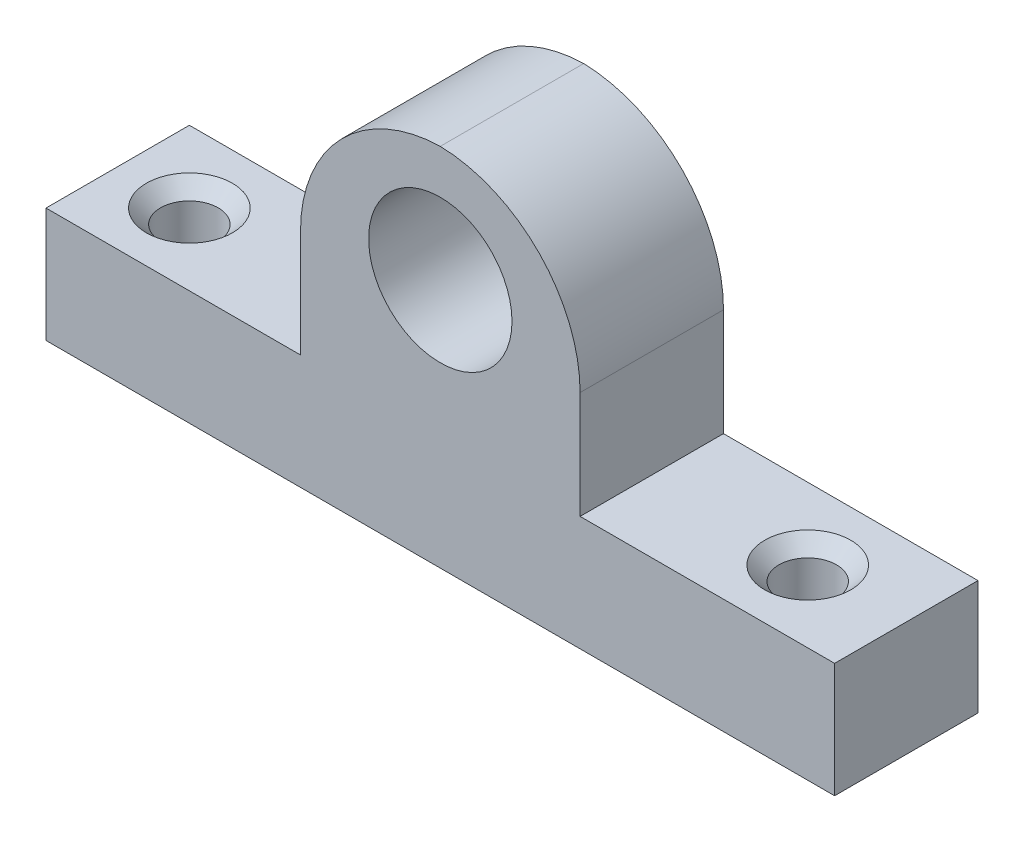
ISO-10303-21;
HEADER;
FILE_DESCRIPTION(('STEP AP214'),'2;1');
FILE_NAME('part.step','',(''),(''),'','','');
FILE_SCHEMA(('AUTOMOTIVE_DESIGN { 1 0 10303 214 1 1 1 1 }'));
ENDSEC;
DATA;
#1=APPLICATION_CONTEXT('core data for automotive mechanical design processes');
#2=APPLICATION_PROTOCOL_DEFINITION('international standard','automotive_design',2000,#1);
#3=PRODUCT_CONTEXT('',#1,'mechanical');
#4=PRODUCT('Part','Part','',(#3));
#5=PRODUCT_RELATED_PRODUCT_CATEGORY('part','',(#4));
#6=PRODUCT_DEFINITION_FORMATION('','',#4);
#7=PRODUCT_DEFINITION_CONTEXT('part definition',#1,'design');
#8=PRODUCT_DEFINITION('design','',#6,#7);
#9=PRODUCT_DEFINITION_SHAPE('','',#8);
#10=(LENGTH_UNIT() NAMED_UNIT(*) SI_UNIT(.MILLI.,.METRE.));
#11=(NAMED_UNIT(*) PLANE_ANGLE_UNIT() SI_UNIT($,.RADIAN.));
#12=(NAMED_UNIT(*) SI_UNIT($,.STERADIAN.) SOLID_ANGLE_UNIT());
#13=UNCERTAINTY_MEASURE_WITH_UNIT(LENGTH_MEASURE(1.E-05),#10,'distance_accuracy_value','');
#14=(GEOMETRIC_REPRESENTATION_CONTEXT(3) GLOBAL_UNCERTAINTY_ASSIGNED_CONTEXT((#13)) GLOBAL_UNIT_ASSIGNED_CONTEXT((#10,
#11,#12)) REPRESENTATION_CONTEXT('',''));
#15=CARTESIAN_POINT('',(0.,0.,0.));
#16=DIRECTION('',(0.,0.,1.));
#17=DIRECTION('',(1.,0.,0.));
#18=AXIS2_PLACEMENT_3D('',#15,#16,#17);
#19=CARTESIAN_POINT('',(0.,0.,0.));
#20=DIRECTION('',(0.,0.,1.));
#21=DIRECTION('',(1.,0.,0.));
#22=AXIS2_PLACEMENT_3D('',#19,#20,#21);
#23=PLANE('',#22);
#24=CARTESIAN_POINT('',(34.925,22.1010883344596,0.));
#25=DIRECTION('',(0.,0.,1.));
#26=DIRECTION('',(1.,0.,0.));
#27=AXIS2_PLACEMENT_3D('',#24,#25,#26);
#28=CIRCLE('',#27,6.35);
#29=CARTESIAN_POINT('',(41.275,22.1010883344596,0.));
#30=VERTEX_POINT('',#29);
#31=EDGE_CURVE('E277',#30,#30,#28,.T.);
#32=ORIENTED_EDGE('',*,*,#31,.T.);
#33=EDGE_LOOP('',(#32));
#34=FACE_BOUND('',#33,.T.);
#35=CARTESIAN_POINT('',(35.2425,19.6596,0.));
#36=DIRECTION('',(0.,0.,1.));
#37=DIRECTION('',(1.,0.,0.));
#38=AXIS2_PLACEMENT_3D('',#35,#36,#37);
#39=CIRCLE('',#38,12.7);
#40=CARTESIAN_POINT('',(22.5425,19.6596,0.));
#41=VERTEX_POINT('',#40);
#42=CARTESIAN_POINT('',(34.925,32.355630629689,0.));
#43=VERTEX_POINT('',#42);
#44=EDGE_CURVE('E94',#41,#43,#39,.F.);
#45=ORIENTED_EDGE('',*,*,#44,.T.);
#46=CARTESIAN_POINT('',(34.6075,19.6596,0.));
#47=DIRECTION('',(0.,0.,1.));
#48=DIRECTION('',(1.,0.,0.));
#49=AXIS2_PLACEMENT_3D('',#46,#47,#48);
#50=CIRCLE('',#49,12.7);
#51=CARTESIAN_POINT('',(47.3075,19.6596,0.));
#52=VERTEX_POINT('',#51);
#53=EDGE_CURVE('E87',#43,#52,#50,.F.);
#54=ORIENTED_EDGE('',*,*,#53,.T.);
#55=DIRECTION('',(0.,-1.,0.));
#56=VECTOR('',#55,1.);
#57=CARTESIAN_POINT('',(47.3075,32.3596,0.));
#58=LINE('',#57,#56);
#59=CARTESIAN_POINT('',(47.3075,10.16,0.));
#60=VERTEX_POINT('',#59);
#61=EDGE_CURVE('E185',#52,#60,#58,.T.);
#62=ORIENTED_EDGE('',*,*,#61,.T.);
#63=DIRECTION('',(1.,0.,0.));
#64=VECTOR('',#63,1.);
#65=CARTESIAN_POINT('',(0.,10.16,0.));
#66=LINE('',#65,#64);
#67=CARTESIAN_POINT('',(69.85,10.16,0.));
#68=VERTEX_POINT('',#67);
#69=EDGE_CURVE('E164',#60,#68,#66,.T.);
#70=ORIENTED_EDGE('',*,*,#69,.T.);
#71=DIRECTION('',(0.,1.,0.));
#72=VECTOR('',#71,1.);
#73=CARTESIAN_POINT('',(69.85,0.,0.));
#74=LINE('',#73,#72);
#75=CARTESIAN_POINT('',(69.85,0.,0.));
#76=VERTEX_POINT('',#75);
#77=EDGE_CURVE('E163',#76,#68,#74,.T.);
#78=ORIENTED_EDGE('',*,*,#77,.F.);
#79=DIRECTION('',(1.,0.,0.));
#80=VECTOR('',#79,1.);
#81=CARTESIAN_POINT('',(0.,0.,0.));
#82=LINE('',#81,#80);
#83=CARTESIAN_POINT('',(0.,0.,0.));
#84=VERTEX_POINT('',#83);
#85=EDGE_CURVE('E228',#84,#76,#82,.T.);
#86=ORIENTED_EDGE('',*,*,#85,.F.);
#87=DIRECTION('',(0.,1.,0.));
#88=VECTOR('',#87,1.);
#89=CARTESIAN_POINT('',(0.,0.,0.));
#90=LINE('',#89,#88);
#91=CARTESIAN_POINT('',(0.,10.16,0.));
#92=VERTEX_POINT('',#91);
#93=EDGE_CURVE('E160',#84,#92,#90,.T.);
#94=ORIENTED_EDGE('',*,*,#93,.T.);
#95=CARTESIAN_POINT('',(22.5425,10.16,0.));
#96=VERTEX_POINT('',#95);
#97=EDGE_CURVE('E157',#92,#96,#66,.T.);
#98=ORIENTED_EDGE('',*,*,#97,.T.);
#99=DIRECTION('',(0.,-1.,0.));
#100=VECTOR('',#99,1.);
#101=CARTESIAN_POINT('',(22.5425,32.3596,0.));
#102=LINE('',#101,#100);
#103=EDGE_CURVE('E147',#41,#96,#102,.T.);
#104=ORIENTED_EDGE('',*,*,#103,.F.);
#105=EDGE_LOOP('',(#45,#54,#62,#70,#78,#86,#94,#98,#104));
#106=FACE_BOUND('',#105,.T.);
#107=ADVANCED_FACE('F77',(#34,#106),#23,.F.);
#108=CARTESIAN_POINT('',(0.,0.,12.7));
#109=DIRECTION('',(0.,0.,1.));
#110=DIRECTION('',(1.,0.,0.));
#111=AXIS2_PLACEMENT_3D('',#108,#109,#110);
#112=PLANE('',#111);
#113=CARTESIAN_POINT('',(34.925,22.1010883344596,12.7));
#114=DIRECTION('',(0.,0.,1.));
#115=DIRECTION('',(1.,0.,0.));
#116=AXIS2_PLACEMENT_3D('',#113,#114,#115);
#117=CIRCLE('',#116,6.35);
#118=CARTESIAN_POINT('',(41.275,22.1010883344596,12.7));
#119=VERTEX_POINT('',#118);
#120=EDGE_CURVE('E282',#119,#119,#117,.T.);
#121=ORIENTED_EDGE('',*,*,#120,.F.);
#122=EDGE_LOOP('',(#121));
#123=FACE_BOUND('',#122,.T.);
#124=DIRECTION('',(0.,-1.,0.));
#125=VECTOR('',#124,1.);
#126=CARTESIAN_POINT('',(47.3075,32.3596,12.7));
#127=LINE('',#126,#125);
#128=CARTESIAN_POINT('',(47.3075,19.6596,12.7));
#129=VERTEX_POINT('',#128);
#130=CARTESIAN_POINT('',(47.3075,10.16,12.7));
#131=VERTEX_POINT('',#130);
#132=EDGE_CURVE('E186',#129,#131,#127,.T.);
#133=ORIENTED_EDGE('',*,*,#132,.F.);
#134=CARTESIAN_POINT('',(34.6075,19.6596,12.7));
#135=DIRECTION('',(0.,0.,1.));
#136=DIRECTION('',(1.,0.,0.));
#137=AXIS2_PLACEMENT_3D('',#134,#135,#136);
#138=CIRCLE('',#137,12.7);
#139=CARTESIAN_POINT('',(34.925,32.355630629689,12.7));
#140=VERTEX_POINT('',#139);
#141=EDGE_CURVE('E253',#129,#140,#138,.T.);
#142=ORIENTED_EDGE('',*,*,#141,.T.);
#143=CARTESIAN_POINT('',(35.2425,19.6596,12.7));
#144=DIRECTION('',(0.,0.,1.));
#145=DIRECTION('',(1.,0.,0.));
#146=AXIS2_PLACEMENT_3D('',#143,#144,#145);
#147=CIRCLE('',#146,12.7);
#148=CARTESIAN_POINT('',(22.5425,19.6596,12.7));
#149=VERTEX_POINT('',#148);
#150=EDGE_CURVE('E250',#140,#149,#147,.T.);
#151=ORIENTED_EDGE('',*,*,#150,.T.);
#152=DIRECTION('',(0.,-1.,0.));
#153=VECTOR('',#152,1.);
#154=CARTESIAN_POINT('',(22.5425,32.3596,12.7));
#155=LINE('',#154,#153);
#156=CARTESIAN_POINT('',(22.5425,10.16,12.7));
#157=VERTEX_POINT('',#156);
#158=EDGE_CURVE('E153',#149,#157,#155,.T.);
#159=ORIENTED_EDGE('',*,*,#158,.T.);
#160=DIRECTION('',(1.,0.,0.));
#161=VECTOR('',#160,1.);
#162=CARTESIAN_POINT('',(0.,10.16,12.7));
#163=LINE('',#162,#161);
#164=CARTESIAN_POINT('',(0.,10.16,12.7));
#165=VERTEX_POINT('',#164);
#166=EDGE_CURVE('E169',#165,#157,#163,.T.);
#167=ORIENTED_EDGE('',*,*,#166,.F.);
#168=DIRECTION('',(0.,1.,0.));
#169=VECTOR('',#168,1.);
#170=CARTESIAN_POINT('',(0.,0.,12.7));
#171=LINE('',#170,#169);
#172=CARTESIAN_POINT('',(0.,0.,12.7));
#173=VERTEX_POINT('',#172);
#174=EDGE_CURVE('E220',#173,#165,#171,.T.);
#175=ORIENTED_EDGE('',*,*,#174,.F.);
#176=DIRECTION('',(1.,0.,0.));
#177=VECTOR('',#176,1.);
#178=CARTESIAN_POINT('',(0.,0.,12.7));
#179=LINE('',#178,#177);
#180=CARTESIAN_POINT('',(69.85,0.,12.7));
#181=VERTEX_POINT('',#180);
#182=EDGE_CURVE('E217',#173,#181,#179,.T.);
#183=ORIENTED_EDGE('',*,*,#182,.T.);
#184=DIRECTION('',(0.,1.,0.));
#185=VECTOR('',#184,1.);
#186=CARTESIAN_POINT('',(69.85,0.,12.7));
#187=LINE('',#186,#185);
#188=CARTESIAN_POINT('',(69.85,10.16,12.7));
#189=VERTEX_POINT('',#188);
#190=EDGE_CURVE('E212',#181,#189,#187,.T.);
#191=ORIENTED_EDGE('',*,*,#190,.T.);
#192=EDGE_CURVE('E213',#131,#189,#163,.T.);
#193=ORIENTED_EDGE('',*,*,#192,.F.);
#194=EDGE_LOOP('',(#133,#142,#151,#159,#167,#175,#183,#191,#193));
#195=FACE_BOUND('',#194,.T.);
#196=ADVANCED_FACE('F273',(#123,#195),#112,.T.);
#197=CARTESIAN_POINT('',(0.,0.,12.7));
#198=DIRECTION('',(0.,1.,0.));
#199=DIRECTION('',(-1.,0.,0.));
#200=AXIS2_PLACEMENT_3D('',#197,#198,#199);
#201=PLANE('',#200);
#202=CARTESIAN_POINT('',(61.11875,0.,6.35));
#203=DIRECTION('',(0.,1.,0.));
#204=DIRECTION('',(0.,0.,1.));
#205=AXIS2_PLACEMENT_3D('',#202,#203,#204);
#206=CIRCLE('',#205,2.55270000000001);
#207=CARTESIAN_POINT('',(61.11875,0.,8.9027));
#208=VERTEX_POINT('',#207);
#209=EDGE_CURVE('E194',#208,#208,#206,.T.);
#210=ORIENTED_EDGE('',*,*,#209,.T.);
#211=EDGE_LOOP('',(#210));
#212=FACE_BOUND('',#211,.T.);
#213=CARTESIAN_POINT('',(6.35000000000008,0.,6.35000000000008));
#214=DIRECTION('',(0.,1.,0.));
#215=DIRECTION('',(0.,0.,1.));
#216=AXIS2_PLACEMENT_3D('',#213,#214,#215);
#217=CIRCLE('',#216,2.5527);
#218=CARTESIAN_POINT('',(6.35000000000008,0.,8.90270000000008));
#219=VERTEX_POINT('',#218);
#220=EDGE_CURVE('E206',#219,#219,#217,.T.);
#221=ORIENTED_EDGE('',*,*,#220,.T.);
#222=EDGE_LOOP('',(#221));
#223=FACE_BOUND('',#222,.T.);
#224=ORIENTED_EDGE('',*,*,#85,.T.);
#225=DIRECTION('',(0.,0.,-1.));
#226=VECTOR('',#225,1.);
#227=CARTESIAN_POINT('',(69.85,0.,12.7));
#228=LINE('',#227,#226);
#229=EDGE_CURVE('E240',#181,#76,#228,.T.);
#230=ORIENTED_EDGE('',*,*,#229,.F.);
#231=ORIENTED_EDGE('',*,*,#182,.F.);
#232=DIRECTION('',(0.,0.,-1.));
#233=VECTOR('',#232,1.);
#234=CARTESIAN_POINT('',(0.,0.,12.7));
#235=LINE('',#234,#233);
#236=EDGE_CURVE('E237',#173,#84,#235,.T.);
#237=ORIENTED_EDGE('',*,*,#236,.T.);
#238=EDGE_LOOP('',(#224,#230,#231,#237));
#239=FACE_BOUND('',#238,.T.);
#240=ADVANCED_FACE('F295',(#212,#223,#239),#201,.F.);
#241=CARTESIAN_POINT('',(69.85,0.,12.7));
#242=DIRECTION('',(-1.,0.,0.));
#243=DIRECTION('',(0.,0.,1.));
#244=AXIS2_PLACEMENT_3D('',#241,#242,#243);
#245=PLANE('',#244);
#246=ORIENTED_EDGE('',*,*,#77,.T.);
#247=DIRECTION('',(0.,0.,-1.));
#248=VECTOR('',#247,1.);
#249=CARTESIAN_POINT('',(69.85,10.16,12.7));
#250=LINE('',#249,#248);
#251=EDGE_CURVE('E223',#189,#68,#250,.T.);
#252=ORIENTED_EDGE('',*,*,#251,.F.);
#253=ORIENTED_EDGE('',*,*,#190,.F.);
#254=ORIENTED_EDGE('',*,*,#229,.T.);
#255=EDGE_LOOP('',(#246,#252,#253,#254));
#256=FACE_BOUND('',#255,.T.);
#257=ADVANCED_FACE('F300',(#256),#245,.F.);
#258=CARTESIAN_POINT('',(0.,0.,12.7));
#259=DIRECTION('',(-1.,0.,0.));
#260=DIRECTION('',(0.,0.,1.));
#261=AXIS2_PLACEMENT_3D('',#258,#259,#260);
#262=PLANE('',#261);
#263=ORIENTED_EDGE('',*,*,#93,.F.);
#264=ORIENTED_EDGE('',*,*,#236,.F.);
#265=ORIENTED_EDGE('',*,*,#174,.T.);
#266=DIRECTION('',(0.,0.,-1.));
#267=VECTOR('',#266,1.);
#268=CARTESIAN_POINT('',(0.,10.16,12.7));
#269=LINE('',#268,#267);
#270=EDGE_CURVE('E233',#165,#92,#269,.T.);
#271=ORIENTED_EDGE('',*,*,#270,.T.);
#272=EDGE_LOOP('',(#263,#264,#265,#271));
#273=FACE_BOUND('',#272,.T.);
#274=ADVANCED_FACE('F308',(#273),#262,.T.);
#275=CARTESIAN_POINT('',(0.,10.16,12.7));
#276=DIRECTION('',(0.,1.,0.));
#277=DIRECTION('',(-1.,0.,0.));
#278=AXIS2_PLACEMENT_3D('',#275,#276,#277);
#279=PLANE('',#278);
#280=CARTESIAN_POINT('',(6.35000000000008,10.16,6.35000000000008));
#281=DIRECTION('',(0.,1.,0.));
#282=DIRECTION('',(0.,0.,1.));
#283=AXIS2_PLACEMENT_3D('',#280,#281,#282);
#284=CIRCLE('',#283,3.81);
#285=CARTESIAN_POINT('',(6.35000000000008,10.16,10.1600000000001));
#286=VERTEX_POINT('',#285);
#287=EDGE_CURVE('E198',#286,#286,#284,.T.);
#288=ORIENTED_EDGE('',*,*,#287,.F.);
#289=EDGE_LOOP('',(#288));
#290=FACE_BOUND('',#289,.T.);
#291=ORIENTED_EDGE('',*,*,#166,.T.);
#292=DIRECTION('',(0.,0.,1.));
#293=VECTOR('',#292,1.);
#294=CARTESIAN_POINT('',(22.5425,10.16,0.));
#295=LINE('',#294,#293);
#296=EDGE_CURVE('E151',#96,#157,#295,.T.);
#297=ORIENTED_EDGE('',*,*,#296,.F.);
#298=ORIENTED_EDGE('',*,*,#97,.F.);
#299=ORIENTED_EDGE('',*,*,#270,.F.);
#300=EDGE_LOOP('',(#291,#297,#298,#299));
#301=FACE_BOUND('',#300,.T.);
#302=ADVANCED_FACE('F167',(#290,#301),#279,.T.);
#303=CARTESIAN_POINT('',(61.11875,10.16,6.35));
#304=DIRECTION('',(0.,1.,0.));
#305=DIRECTION('',(0.,0.,1.));
#306=AXIS2_PLACEMENT_3D('',#303,#304,#305);
#307=CIRCLE('',#306,3.80999999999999);
#308=CARTESIAN_POINT('',(61.11875,10.16,10.16));
#309=VERTEX_POINT('',#308);
#310=EDGE_CURVE('E171',#309,#309,#307,.T.);
#311=ORIENTED_EDGE('',*,*,#310,.F.);
#312=EDGE_LOOP('',(#311));
#313=FACE_BOUND('',#312,.T.);
#314=ORIENTED_EDGE('',*,*,#69,.F.);
#315=DIRECTION('',(0.,0.,1.));
#316=VECTOR('',#315,1.);
#317=CARTESIAN_POINT('',(47.3075,10.16,0.));
#318=LINE('',#317,#316);
#319=EDGE_CURVE('E181',#60,#131,#318,.T.);
#320=ORIENTED_EDGE('',*,*,#319,.T.);
#321=ORIENTED_EDGE('',*,*,#192,.T.);
#322=ORIENTED_EDGE('',*,*,#251,.T.);
#323=EDGE_LOOP('',(#314,#320,#321,#322));
#324=FACE_BOUND('',#323,.T.);
#325=ADVANCED_FACE('F315',(#313,#324),#279,.T.);
#326=CARTESIAN_POINT('',(6.35000000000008,10.16,6.35000000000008));
#327=DIRECTION('',(0.,1.,0.));
#328=DIRECTION('',(0.,0.,1.));
#329=AXIS2_PLACEMENT_3D('',#326,#327,#328);
#330=CYLINDRICAL_SURFACE('',#329,2.55269999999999);
#331=ORIENTED_EDGE('',*,*,#220,.F.);
#332=EDGE_LOOP('',(#331));
#333=FACE_BOUND('',#332,.T.);
#334=CARTESIAN_POINT('',(6.35000000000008,8.9027,6.35000000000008));
#335=DIRECTION('',(0.,1.,0.));
#336=DIRECTION('',(0.,0.,1.));
#337=AXIS2_PLACEMENT_3D('',#334,#335,#336);
#338=CIRCLE('',#337,2.55269999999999);
#339=CARTESIAN_POINT('',(6.35000000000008,8.9027,8.90270000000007));
#340=VERTEX_POINT('',#339);
#341=EDGE_CURVE('E202',#340,#340,#338,.T.);
#342=ORIENTED_EDGE('',*,*,#341,.T.);
#343=EDGE_LOOP('',(#342));
#344=FACE_BOUND('',#343,.T.);
#345=ADVANCED_FACE('F305',(#333,#344),#330,.F.);
#346=CARTESIAN_POINT('',(6.35000000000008,10.16,6.35000000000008));
#347=DIRECTION('',(0.,1.,0.));
#348=DIRECTION('',(0.,0.,1.));
#349=AXIS2_PLACEMENT_3D('',#346,#347,#348);
#350=CONICAL_SURFACE('',#349,3.81,0.785398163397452);
#351=ORIENTED_EDGE('',*,*,#341,.F.);
#352=EDGE_LOOP('',(#351));
#353=FACE_BOUND('',#352,.T.);
#354=ORIENTED_EDGE('',*,*,#287,.T.);
#355=EDGE_LOOP('',(#354));
#356=FACE_BOUND('',#355,.T.);
#357=ADVANCED_FACE('F337',(#353,#356),#350,.F.);
#358=CARTESIAN_POINT('',(61.11875,10.16,6.35));
#359=DIRECTION('',(0.,1.,0.));
#360=DIRECTION('',(0.,0.,1.));
#361=AXIS2_PLACEMENT_3D('',#358,#359,#360);
#362=CYLINDRICAL_SURFACE('',#361,2.5527);
#363=ORIENTED_EDGE('',*,*,#209,.F.);
#364=EDGE_LOOP('',(#363));
#365=FACE_BOUND('',#364,.T.);
#366=CARTESIAN_POINT('',(61.11875,8.90270000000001,6.35));
#367=DIRECTION('',(0.,1.,0.));
#368=DIRECTION('',(0.,0.,1.));
#369=AXIS2_PLACEMENT_3D('',#366,#367,#368);
#370=CIRCLE('',#369,2.55269999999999);
#371=CARTESIAN_POINT('',(61.11875,8.90270000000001,8.90269999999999));
#372=VERTEX_POINT('',#371);
#373=EDGE_CURVE('E177',#372,#372,#370,.T.);
#374=ORIENTED_EDGE('',*,*,#373,.T.);
#375=EDGE_LOOP('',(#374));
#376=FACE_BOUND('',#375,.T.);
#377=ADVANCED_FACE('F334',(#365,#376),#362,.F.);
#378=CARTESIAN_POINT('',(61.11875,10.16,6.35));
#379=DIRECTION('',(0.,1.,0.));
#380=DIRECTION('',(0.,0.,1.));
#381=AXIS2_PLACEMENT_3D('',#378,#379,#380);
#382=CONICAL_SURFACE('',#381,3.80999999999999,0.785398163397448);
#383=ORIENTED_EDGE('',*,*,#373,.F.);
#384=EDGE_LOOP('',(#383));
#385=FACE_BOUND('',#384,.T.);
#386=ORIENTED_EDGE('',*,*,#310,.T.);
#387=EDGE_LOOP('',(#386));
#388=FACE_BOUND('',#387,.T.);
#389=ADVANCED_FACE('F329',(#385,#388),#382,.F.);
#390=CARTESIAN_POINT('',(47.3075,32.3596,0.));
#391=DIRECTION('',(-1.,0.,0.));
#392=DIRECTION('',(0.,0.,1.));
#393=AXIS2_PLACEMENT_3D('',#390,#391,#392);
#394=PLANE('',#393);
#395=ORIENTED_EDGE('',*,*,#61,.F.);
#396=DIRECTION('',(0.,0.,1.));
#397=VECTOR('',#396,1.);
#398=CARTESIAN_POINT('',(47.3075,19.6596,12.7));
#399=LINE('',#398,#397);
#400=EDGE_CURVE('E236',#52,#129,#399,.T.);
#401=ORIENTED_EDGE('',*,*,#400,.T.);
#402=ORIENTED_EDGE('',*,*,#132,.T.);
#403=ORIENTED_EDGE('',*,*,#319,.F.);
#404=EDGE_LOOP('',(#395,#401,#402,#403));
#405=FACE_BOUND('',#404,.T.);
#406=ADVANCED_FACE('F268',(#405),#394,.F.);
#407=CARTESIAN_POINT('',(22.5425,32.3596,0.));
#408=DIRECTION('',(-1.,0.,0.));
#409=DIRECTION('',(0.,-1.,0.));
#410=AXIS2_PLACEMENT_3D('',#407,#408,#409);
#411=PLANE('',#410);
#412=ORIENTED_EDGE('',*,*,#158,.F.);
#413=DIRECTION('',(0.,0.,1.));
#414=VECTOR('',#413,1.);
#415=CARTESIAN_POINT('',(22.5425,19.6596,0.));
#416=LINE('',#415,#414);
#417=EDGE_CURVE('E12',#149,#41,#416,.F.);
#418=ORIENTED_EDGE('',*,*,#417,.T.);
#419=ORIENTED_EDGE('',*,*,#103,.T.);
#420=ORIENTED_EDGE('',*,*,#296,.T.);
#421=EDGE_LOOP('',(#412,#418,#419,#420));
#422=FACE_BOUND('',#421,.T.);
#423=ADVANCED_FACE('F149',(#422),#411,.T.);
#424=CARTESIAN_POINT('',(35.2425,19.6596,12.7));
#425=DIRECTION('',(0.,0.,1.));
#426=DIRECTION('',(1.,0.,0.));
#427=AXIS2_PLACEMENT_3D('',#424,#425,#426);
#428=CYLINDRICAL_SURFACE('',#427,12.7);
#429=DIRECTION('',(0.,0.,1.));
#430=VECTOR('',#429,1.);
#431=CARTESIAN_POINT('',(34.925,32.355630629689,6.35));
#432=LINE('',#431,#430);
#433=EDGE_CURVE('E81',#43,#140,#432,.T.);
#434=ORIENTED_EDGE('',*,*,#433,.F.);
#435=ORIENTED_EDGE('',*,*,#44,.F.);
#436=ORIENTED_EDGE('',*,*,#417,.F.);
#437=ORIENTED_EDGE('',*,*,#150,.F.);
#438=EDGE_LOOP('',(#434,#435,#436,#437));
#439=FACE_BOUND('',#438,.T.);
#440=ADVANCED_FACE('F79',(#439),#428,.T.);
#441=CARTESIAN_POINT('',(34.6075,19.6596,0.));
#442=DIRECTION('',(0.,0.,-1.));
#443=DIRECTION('',(-1.,0.,0.));
#444=AXIS2_PLACEMENT_3D('',#441,#442,#443);
#445=CYLINDRICAL_SURFACE('',#444,12.7);
#446=ORIENTED_EDGE('',*,*,#53,.F.);
#447=ORIENTED_EDGE('',*,*,#433,.T.);
#448=ORIENTED_EDGE('',*,*,#141,.F.);
#449=ORIENTED_EDGE('',*,*,#400,.F.);
#450=EDGE_LOOP('',(#446,#447,#448,#449));
#451=FACE_BOUND('',#450,.T.);
#452=ADVANCED_FACE('F270',(#451),#445,.T.);
#453=CARTESIAN_POINT('',(34.925,22.1010883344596,0.));
#454=DIRECTION('',(0.,0.,1.));
#455=DIRECTION('',(1.,0.,0.));
#456=AXIS2_PLACEMENT_3D('',#453,#454,#455);
#457=CYLINDRICAL_SURFACE('',#456,6.35);
#458=ORIENTED_EDGE('',*,*,#31,.F.);
#459=EDGE_LOOP('',(#458));
#460=FACE_BOUND('',#459,.T.);
#461=ORIENTED_EDGE('',*,*,#120,.T.);
#462=EDGE_LOOP('',(#461));
#463=FACE_BOUND('',#462,.T.);
#464=ADVANCED_FACE('F292',(#460,#463),#457,.F.);
#465=CLOSED_SHELL('',(#107,#196,#240,#257,#274,#302,#325,#345,#357,#377,#389,#406,#423,#440,
#452,#464));
#466=MANIFOLD_SOLID_BREP('B2',#465);
#467=ADVANCED_BREP_SHAPE_REPRESENTATION('',(#18,#466),#14);
#468=SHAPE_DEFINITION_REPRESENTATION(#9,#467);
ENDSEC;
END-ISO-10303-21;
